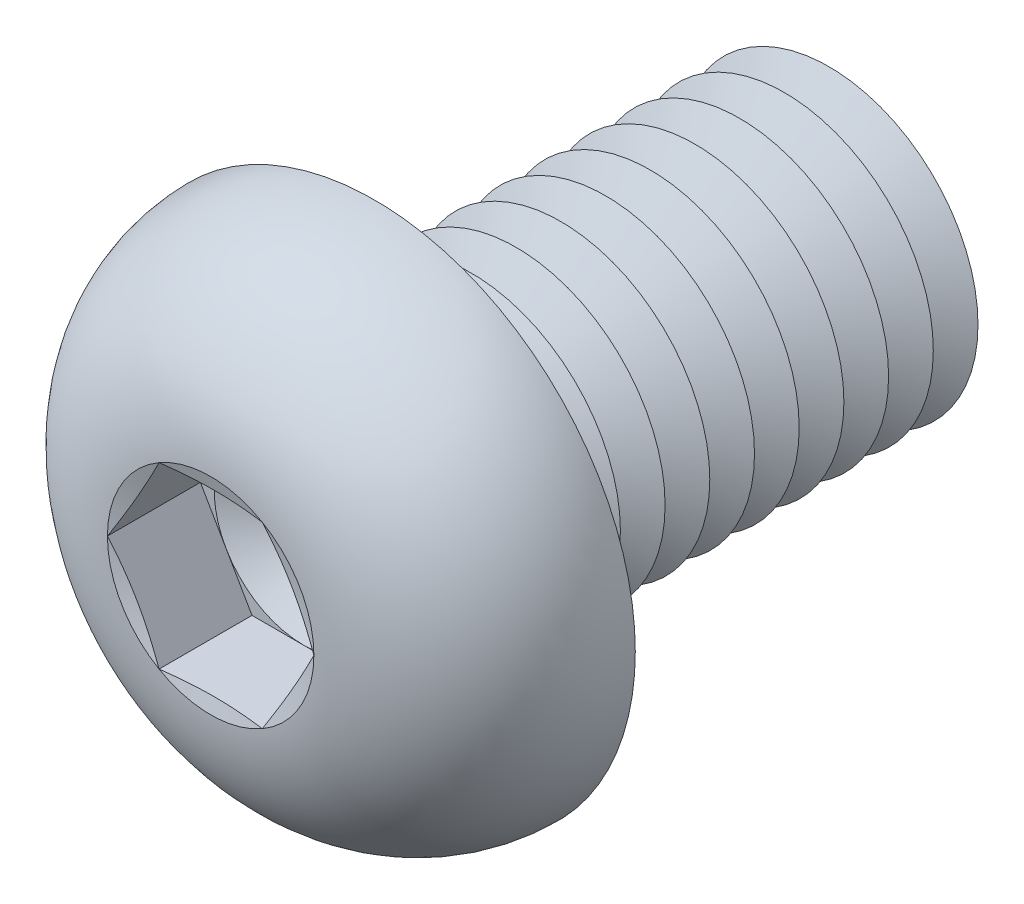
ISO-10303-21;
HEADER;
FILE_DESCRIPTION(('STEP AP214'),'2;1');
FILE_NAME('part.step','',(''),(''),'','','');
FILE_SCHEMA(('AUTOMOTIVE_DESIGN { 1 0 10303 214 1 1 1 1 }'));
ENDSEC;
DATA;
#1=APPLICATION_CONTEXT('core data for automotive mechanical design processes');
#2=APPLICATION_PROTOCOL_DEFINITION('international standard','automotive_design',2000,#1);
#3=PRODUCT_CONTEXT('',#1,'mechanical');
#4=PRODUCT('Part','Part','',(#3));
#5=PRODUCT_RELATED_PRODUCT_CATEGORY('part','',(#4));
#6=PRODUCT_DEFINITION_FORMATION('','',#4);
#7=PRODUCT_DEFINITION_CONTEXT('part definition',#1,'design');
#8=PRODUCT_DEFINITION('design','',#6,#7);
#9=PRODUCT_DEFINITION_SHAPE('','',#8);
#10=(LENGTH_UNIT() NAMED_UNIT(*) SI_UNIT(.MILLI.,.METRE.));
#11=(NAMED_UNIT(*) PLANE_ANGLE_UNIT() SI_UNIT($,.RADIAN.));
#12=(NAMED_UNIT(*) SI_UNIT($,.STERADIAN.) SOLID_ANGLE_UNIT());
#13=UNCERTAINTY_MEASURE_WITH_UNIT(LENGTH_MEASURE(1.E-05),#10,'distance_accuracy_value','');
#14=(GEOMETRIC_REPRESENTATION_CONTEXT(3) GLOBAL_UNCERTAINTY_ASSIGNED_CONTEXT((#13)) GLOBAL_UNIT_ASSIGNED_CONTEXT((#10,
#11,#12)) REPRESENTATION_CONTEXT('',''));
#15=CARTESIAN_POINT('',(0.,0.,0.));
#16=DIRECTION('',(0.,0.,1.));
#17=DIRECTION('',(1.,0.,0.));
#18=AXIS2_PLACEMENT_3D('',#15,#16,#17);
#19=CARTESIAN_POINT('',(0.,0.,2.38));
#20=DIRECTION('',(0.,0.,1.));
#21=DIRECTION('',(1.,0.,0.));
#22=AXIS2_PLACEMENT_3D('',#19,#20,#21);
#23=PLANE('',#22);
#24=CARTESIAN_POINT('',(0.,0.,2.38));
#25=DIRECTION('',(0.,0.,1.));
#26=DIRECTION('',(1.,0.,0.));
#27=AXIS2_PLACEMENT_3D('',#24,#25,#26);
#28=CIRCLE('',#27,2.99999860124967);
#29=CARTESIAN_POINT('',(2.598075,1.49999930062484,2.38));
#30=VERTEX_POINT('',#29);
#31=CARTESIAN_POINT('',(0.,2.99999860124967,2.38));
#32=VERTEX_POINT('',#31);
#33=EDGE_CURVE('E118',#30,#32,#28,.T.);
#34=ORIENTED_EDGE('',*,*,#33,.F.);
#35=DIRECTION('',(-0.500000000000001,0.866025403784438,0.));
#36=VECTOR('',#35,1.);
#37=CARTESIAN_POINT('',(3.4641,0.,2.38));
#38=LINE('',#37,#36);
#39=CARTESIAN_POINT('',(1.73205,2.99999860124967,2.38));
#40=VERTEX_POINT('',#39);
#41=EDGE_CURVE('E125',#30,#40,#38,.T.);
#42=ORIENTED_EDGE('',*,*,#41,.T.);
#43=DIRECTION('',(-1.,0.,0.));
#44=VECTOR('',#43,1.);
#45=CARTESIAN_POINT('',(1.73205,2.99999860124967,2.38));
#46=LINE('',#45,#44);
#47=EDGE_CURVE('E136',#40,#32,#46,.T.);
#48=ORIENTED_EDGE('',*,*,#47,.T.);
#49=EDGE_LOOP('',(#34,#42,#48));
#50=FACE_BOUND('',#49,.T.);
#51=ADVANCED_FACE('F39',(#50),#23,.T.);
#52=CARTESIAN_POINT('',(0.,0.,2.38));
#53=DIRECTION('',(0.,0.,1.));
#54=DIRECTION('',(1.,0.,0.));
#55=AXIS2_PLACEMENT_3D('',#52,#53,#54);
#56=CIRCLE('',#55,2.99999860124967);
#57=CARTESIAN_POINT('',(-2.598075,1.49999930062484,2.38));
#58=VERTEX_POINT('',#57);
#59=EDGE_CURVE('E11',#32,#58,#56,.T.);
#60=ORIENTED_EDGE('',*,*,#59,.F.);
#61=CARTESIAN_POINT('',(-1.73205,2.99999860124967,2.38));
#62=VERTEX_POINT('',#61);
#63=EDGE_CURVE('E131',#32,#62,#46,.T.);
#64=ORIENTED_EDGE('',*,*,#63,.T.);
#65=DIRECTION('',(-0.5,-0.866025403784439,0.));
#66=VECTOR('',#65,1.);
#67=CARTESIAN_POINT('',(-1.73205,2.99999860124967,2.38));
#68=LINE('',#67,#66);
#69=EDGE_CURVE('E134',#62,#58,#68,.T.);
#70=ORIENTED_EDGE('',*,*,#69,.T.);
#71=EDGE_LOOP('',(#60,#64,#70));
#72=FACE_BOUND('',#71,.T.);
#73=ADVANCED_FACE('F130',(#72),#23,.T.);
#74=CARTESIAN_POINT('',(-2.598075,-1.49999930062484,2.38));
#75=VERTEX_POINT('',#74);
#76=EDGE_CURVE('E49',#58,#75,#56,.T.);
#77=ORIENTED_EDGE('',*,*,#76,.F.);
#78=CARTESIAN_POINT('',(-3.4641,0.,2.38));
#79=VERTEX_POINT('',#78);
#80=EDGE_CURVE('E143',#58,#79,#68,.T.);
#81=ORIENTED_EDGE('',*,*,#80,.T.);
#82=DIRECTION('',(0.5,-0.866025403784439,0.));
#83=VECTOR('',#82,1.);
#84=CARTESIAN_POINT('',(-3.4641,0.,2.38));
#85=LINE('',#84,#83);
#86=EDGE_CURVE('E151',#79,#75,#85,.T.);
#87=ORIENTED_EDGE('',*,*,#86,.T.);
#88=EDGE_LOOP('',(#77,#81,#87));
#89=FACE_BOUND('',#88,.T.);
#90=ADVANCED_FACE('F372',(#89),#23,.T.);
#91=CARTESIAN_POINT('',(0.,-2.99999860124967,2.38));
#92=VERTEX_POINT('',#91);
#93=EDGE_CURVE('E363',#75,#92,#56,.T.);
#94=ORIENTED_EDGE('',*,*,#93,.F.);
#95=CARTESIAN_POINT('',(-1.73205,-2.99999860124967,2.38));
#96=VERTEX_POINT('',#95);
#97=EDGE_CURVE('E150',#75,#96,#85,.T.);
#98=ORIENTED_EDGE('',*,*,#97,.T.);
#99=DIRECTION('',(1.,0.,0.));
#100=VECTOR('',#99,1.);
#101=CARTESIAN_POINT('',(-1.73205,-2.99999860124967,2.38));
#102=LINE('',#101,#100);
#103=EDGE_CURVE('E156',#96,#92,#102,.T.);
#104=ORIENTED_EDGE('',*,*,#103,.T.);
#105=EDGE_LOOP('',(#94,#98,#104));
#106=FACE_BOUND('',#105,.T.);
#107=ADVANCED_FACE('F369',(#106),#23,.T.);
#108=CARTESIAN_POINT('',(2.598075,-1.49999930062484,2.38));
#109=VERTEX_POINT('',#108);
#110=EDGE_CURVE('E56',#92,#109,#56,.T.);
#111=ORIENTED_EDGE('',*,*,#110,.F.);
#112=CARTESIAN_POINT('',(1.73205,-2.99999860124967,2.38));
#113=VERTEX_POINT('',#112);
#114=EDGE_CURVE('E155',#92,#113,#102,.T.);
#115=ORIENTED_EDGE('',*,*,#114,.T.);
#116=DIRECTION('',(0.5,0.866025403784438,0.));
#117=VECTOR('',#116,1.);
#118=CARTESIAN_POINT('',(1.73205,-2.99999860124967,2.38));
#119=LINE('',#118,#117);
#120=EDGE_CURVE('E161',#113,#109,#119,.T.);
#121=ORIENTED_EDGE('',*,*,#120,.T.);
#122=EDGE_LOOP('',(#111,#115,#121));
#123=FACE_BOUND('',#122,.T.);
#124=ADVANCED_FACE('F353',(#123),#23,.T.);
#125=CARTESIAN_POINT('',(0.,0.,5.5));
#126=DIRECTION('',(0.,0.,1.));
#127=DIRECTION('',(1.,0.,0.));
#128=AXIS2_PLACEMENT_3D('',#125,#126,#127);
#129=CONICAL_SURFACE('',#128,3.4641,1.30899693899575);
#130=CARTESIAN_POINT('',(3.46421547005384,-0.000199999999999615,5.50003094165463));
#131=CARTESIAN_POINT('',(3.39227822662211,0.124398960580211,5.48074619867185));
#132=CARTESIAN_POINT('',(3.32021054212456,0.24922385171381,5.46323875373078));
#133=CARTESIAN_POINT('',(3.17582062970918,0.49931451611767,5.43247971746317));
#134=CARTESIAN_POINT('',(3.10349831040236,0.62458044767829,5.41922985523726));
#135=CARTESIAN_POINT('',(2.95903767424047,0.874793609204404,5.39775958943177));
#136=CARTESIAN_POINT('',(2.88690033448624,0.999739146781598,5.38951357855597));
#137=CARTESIAN_POINT('',(2.74253364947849,1.24978958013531,5.37845651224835));
#138=CARTESIAN_POINT('',(2.67030432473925,1.37489444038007,5.3756444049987));
#139=CARTESIAN_POINT('',(2.52584567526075,1.6251041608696,5.3756444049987));
#140=CARTESIAN_POINT('',(2.45361635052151,1.75020902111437,5.37845651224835));
#141=CARTESIAN_POINT('',(2.30924966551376,2.00025945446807,5.38951357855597));
#142=CARTESIAN_POINT('',(2.23711232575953,2.12520499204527,5.39775958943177));
#143=CARTESIAN_POINT('',(2.09265168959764,2.37541815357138,5.41922985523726));
#144=CARTESIAN_POINT('',(2.02032937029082,2.500684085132,5.43247971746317));
#145=CARTESIAN_POINT('',(1.87593945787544,2.75077474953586,5.46323875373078));
#146=CARTESIAN_POINT('',(1.80387177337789,2.87559964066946,5.48074619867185));
#147=CARTESIAN_POINT('',(1.73193452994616,3.00019860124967,5.50003094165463));
#148=B_SPLINE_CURVE_WITH_KNOTS('',3,(#130,#131,#132,#133,#134,#135,#136,#137,#138,#139,#140,
#141,#142,#143,#144,#145,#146,#147),.UNSPECIFIED.,.F.,.F.,(4,2,2,2,2,2,2,2,4),(0.,
0.435506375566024,0.871189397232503,1.3046235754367,1.7379738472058,2.1713241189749,
2.6047582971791,3.04044131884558,3.4759476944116),.UNSPECIFIED.);
#149=CARTESIAN_POINT('',(3.4641,0.,5.5));
#150=VERTEX_POINT('',#149);
#151=CARTESIAN_POINT('',(1.73204999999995,2.9999986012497,5.5));
#152=VERTEX_POINT('',#151);
#153=EDGE_CURVE('E227',#150,#152,#148,.T.);
#154=ORIENTED_EDGE('',*,*,#153,.F.);
#155=CARTESIAN_POINT('',(0.,0.,5.5));
#156=DIRECTION('',(0.,0.,-1.));
#157=DIRECTION('',(-1.,0.,0.));
#158=AXIS2_PLACEMENT_3D('',#155,#156,#157);
#159=CIRCLE('',#158,3.4641);
#160=EDGE_CURVE('E307',#152,#150,#159,.T.);
#161=ORIENTED_EDGE('',*,*,#160,.F.);
#162=EDGE_LOOP('',(#154,#161));
#163=FACE_BOUND('',#162,.T.);
#164=ADVANCED_FACE('F347',(#163),#129,.F.);
#165=CARTESIAN_POINT('',(1.73193452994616,-3.00019860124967,5.50003094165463));
#166=CARTESIAN_POINT('',(1.80387177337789,-2.87559964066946,5.48074619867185));
#167=CARTESIAN_POINT('',(1.87593945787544,-2.75077474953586,5.46323875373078));
#168=CARTESIAN_POINT('',(2.02032937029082,-2.500684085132,5.43247971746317));
#169=CARTESIAN_POINT('',(2.09265168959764,-2.37541815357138,5.41922985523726));
#170=CARTESIAN_POINT('',(2.23711232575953,-2.12520499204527,5.39775958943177));
#171=CARTESIAN_POINT('',(2.30924966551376,-2.00025945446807,5.38951357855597));
#172=CARTESIAN_POINT('',(2.45361635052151,-1.75020902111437,5.37845651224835));
#173=CARTESIAN_POINT('',(2.52584567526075,-1.6251041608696,5.3756444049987));
#174=CARTESIAN_POINT('',(2.67030432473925,-1.37489444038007,5.3756444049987));
#175=CARTESIAN_POINT('',(2.74253364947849,-1.24978958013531,5.37845651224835));
#176=CARTESIAN_POINT('',(2.88690033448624,-0.999739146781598,5.38951357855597));
#177=CARTESIAN_POINT('',(2.95903767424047,-0.874793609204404,5.39775958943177));
#178=CARTESIAN_POINT('',(3.10349831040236,-0.624580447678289,5.41922985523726));
#179=CARTESIAN_POINT('',(3.17582062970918,-0.499314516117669,5.43247971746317));
#180=CARTESIAN_POINT('',(3.32021054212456,-0.249223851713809,5.46323875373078));
#181=CARTESIAN_POINT('',(3.39227822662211,-0.124398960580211,5.48074619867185));
#182=CARTESIAN_POINT('',(3.46421547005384,0.000200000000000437,5.50003094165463));
#183=B_SPLINE_CURVE_WITH_KNOTS('',3,(#165,#166,#167,#168,#169,#170,#171,#172,#173,#174,#175,
#176,#177,#178,#179,#180,#181,#182),.UNSPECIFIED.,.F.,.F.,(4,2,2,2,2,2,2,2,4),(0.,
0.435506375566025,0.871189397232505,1.3046235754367,1.7379738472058,2.1713241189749,
2.6047582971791,3.04044131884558,3.4759476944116),.UNSPECIFIED.);
#184=CARTESIAN_POINT('',(1.73205,-2.99999860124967,5.5));
#185=VERTEX_POINT('',#184);
#186=EDGE_CURVE('E230',#185,#150,#183,.T.);
#187=ORIENTED_EDGE('',*,*,#186,.F.);
#188=EDGE_CURVE('E289',#150,#185,#159,.T.);
#189=ORIENTED_EDGE('',*,*,#188,.F.);
#190=EDGE_LOOP('',(#187,#189));
#191=FACE_BOUND('',#190,.T.);
#192=ADVANCED_FACE('F287',(#191),#129,.F.);
#193=CARTESIAN_POINT('',(-5.2273006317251,-2.99999860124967,6.18672552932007));
#194=CARTESIAN_POINT('',(-5.10075887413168,-2.99999860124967,6.15732018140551));
#195=CARTESIAN_POINT('',(-4.97415993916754,-2.99999860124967,6.12816064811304));
#196=CARTESIAN_POINT('',(-4.72082394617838,-2.99999860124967,6.07043857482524));
#197=CARTESIAN_POINT('',(-4.59408688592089,-2.99999860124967,6.04187604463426));
#198=CARTESIAN_POINT('',(-4.21358997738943,-2.99999860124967,5.95723252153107));
#199=CARTESIAN_POINT('',(-3.95959339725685,-2.99999860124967,5.90220706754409));
#200=CARTESIAN_POINT('',(-3.44835573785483,-2.99999860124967,5.79574115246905));
#201=CARTESIAN_POINT('',(-3.19110656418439,-2.99999860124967,5.74433913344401));
#202=CARTESIAN_POINT('',(-2.67540790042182,-2.99999860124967,5.6477299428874));
#203=CARTESIAN_POINT('',(-2.41695830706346,-2.99999860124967,5.60252331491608));
#204=CARTESIAN_POINT('',(-1.9055512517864,-2.99999860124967,5.52251897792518));
#205=CARTESIAN_POINT('',(-1.65263426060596,-2.99999860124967,5.48747285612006));
#206=CARTESIAN_POINT('',(-1.27220564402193,-2.99999860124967,5.44439602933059));
#207=CARTESIAN_POINT('',(-1.1452320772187,-2.99999860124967,5.43161987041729));
#208=CARTESIAN_POINT('',(-0.890973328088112,-2.99999860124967,5.40972605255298));
#209=CARTESIAN_POINT('',(-0.76368816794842,-2.99999860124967,5.40060814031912));
#210=CARTESIAN_POINT('',(-0.50944206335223,-2.99999860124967,5.38647457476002));
#211=CARTESIAN_POINT('',(-0.382482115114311,-2.99999860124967,5.38144125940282));
#212=CARTESIAN_POINT('',(-0.128463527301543,-2.99999860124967,5.37566637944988));
#213=CARTESIAN_POINT('',(-0.00140488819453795,-2.99999860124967,5.37492479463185));
#214=CARTESIAN_POINT('',(0.252672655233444,-2.99999860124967,5.37777315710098));
#215=CARTESIAN_POINT('',(0.379691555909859,-2.99999860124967,5.38136342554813));
#216=CARTESIAN_POINT('',(0.633540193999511,-2.99999860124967,5.39268816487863));
#217=CARTESIAN_POINT('',(0.760369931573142,-2.99999860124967,5.40042263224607));
#218=CARTESIAN_POINT('',(1.06836981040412,-2.99999860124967,5.42382465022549));
#219=CARTESIAN_POINT('',(1.24938929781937,-2.99999860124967,5.44147485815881));
#220=CARTESIAN_POINT('',(1.61066786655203,-2.99999860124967,5.48312309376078));
#221=CARTESIAN_POINT('',(1.7909269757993,-2.99999860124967,5.50712088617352));
#222=CARTESIAN_POINT('',(2.15127612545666,-2.99999860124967,5.56013471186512));
#223=CARTESIAN_POINT('',(2.33136383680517,-2.99999860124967,5.58916634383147));
#224=CARTESIAN_POINT('',(2.690892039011,-2.99999860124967,5.65100028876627));
#225=CARTESIAN_POINT('',(2.87033249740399,-2.99999860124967,5.68380278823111));
#226=CARTESIAN_POINT('',(3.23235399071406,-2.99999860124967,5.75295369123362));
#227=CARTESIAN_POINT('',(3.4149236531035,-2.99999860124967,5.78936117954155));
#228=CARTESIAN_POINT('',(3.77960351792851,-2.99999860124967,5.864406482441));
#229=CARTESIAN_POINT('',(3.96171371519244,-2.99999860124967,5.903044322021));
#230=CARTESIAN_POINT('',(4.32457472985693,-2.99999860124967,5.9817966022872));
#231=CARTESIAN_POINT('',(4.5053275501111,-2.99999860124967,6.02190185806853));
#232=CARTESIAN_POINT('',(4.86652484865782,-2.99999860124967,6.10342152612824));
#233=CARTESIAN_POINT('',(5.04696934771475,-2.99999860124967,6.14483584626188));
#234=CARTESIAN_POINT('',(5.2273006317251,-2.99999860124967,6.18672552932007));
#235=B_SPLINE_CURVE_WITH_KNOTS('',3,(#193,#194,#195,#196,#197,#198,#199,#200,#201,#202,#203,
#204,#205,#206,#207,#208,#209,#210,#211,#212,#213,#214,#215,#216,#217,#218,#219,#220,#221,#222,
#223,#224,#225,#226,#227,#228,#229,#230,#231,#232,#233,#234),.UNSPECIFIED.,.F.,.F.,(4,2,2,2,2,2,
2,2,2,2,2,2,2,2,2,2,2,2,2,2,4),(0.,0.389739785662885,0.779485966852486,1.5591292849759,
2.34608117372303,3.13310206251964,3.8988410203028,4.28164148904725,4.66441544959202,
5.04552531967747,5.42663339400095,5.80776972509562,6.18890573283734,6.73438998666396,
7.27985402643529,7.8270395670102,8.37425218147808,8.93272720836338,9.49120849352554,
10.0466490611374,10.6020506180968),.UNSPECIFIED.);
#236=CARTESIAN_POINT('',(-1.73205,-2.99999860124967,5.5));
#237=VERTEX_POINT('',#236);
#238=EDGE_CURVE('E240',#237,#185,#235,.T.);
#239=ORIENTED_EDGE('',*,*,#238,.F.);
#240=EDGE_CURVE('E294',#185,#237,#159,.T.);
#241=ORIENTED_EDGE('',*,*,#240,.F.);
#242=EDGE_LOOP('',(#239,#241));
#243=FACE_BOUND('',#242,.T.);
#244=ADVANCED_FACE('F295',(#243),#129,.F.);
#245=CARTESIAN_POINT('',(-3.46421547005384,0.000200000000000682,5.50003094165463));
#246=CARTESIAN_POINT('',(-3.39227822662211,-0.12439896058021,5.48074619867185));
#247=CARTESIAN_POINT('',(-3.32021054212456,-0.249223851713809,5.46323875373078));
#248=CARTESIAN_POINT('',(-3.17582062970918,-0.499314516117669,5.43247971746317));
#249=CARTESIAN_POINT('',(-3.10349831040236,-0.624580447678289,5.41922985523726));
#250=CARTESIAN_POINT('',(-2.95903767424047,-0.874793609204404,5.39775958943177));
#251=CARTESIAN_POINT('',(-2.88690033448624,-0.999739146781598,5.38951357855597));
#252=CARTESIAN_POINT('',(-2.74253364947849,-1.24978958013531,5.37845651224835));
#253=CARTESIAN_POINT('',(-2.67030432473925,-1.37489444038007,5.3756444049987));
#254=CARTESIAN_POINT('',(-2.52584567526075,-1.6251041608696,5.3756444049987));
#255=CARTESIAN_POINT('',(-2.45361635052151,-1.75020902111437,5.37845651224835));
#256=CARTESIAN_POINT('',(-2.30924966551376,-2.00025945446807,5.38951357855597));
#257=CARTESIAN_POINT('',(-2.23711232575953,-2.12520499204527,5.39775958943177));
#258=CARTESIAN_POINT('',(-2.09265168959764,-2.37541815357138,5.41922985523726));
#259=CARTESIAN_POINT('',(-2.02032937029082,-2.500684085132,5.43247971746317));
#260=CARTESIAN_POINT('',(-1.87593945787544,-2.75077474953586,5.46323875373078));
#261=CARTESIAN_POINT('',(-1.80387177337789,-2.87559964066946,5.48074619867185));
#262=CARTESIAN_POINT('',(-1.73193452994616,-3.00019860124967,5.50003094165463));
#263=B_SPLINE_CURVE_WITH_KNOTS('',3,(#245,#246,#247,#248,#249,#250,#251,#252,#253,#254,#255,
#256,#257,#258,#259,#260,#261,#262),.UNSPECIFIED.,.F.,.F.,(4,2,2,2,2,2,2,2,4),(0.,
0.435506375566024,0.871189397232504,1.3046235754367,1.7379738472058,2.1713241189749,
2.6047582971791,3.04044131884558,3.4759476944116),.UNSPECIFIED.);
#264=CARTESIAN_POINT('',(-3.4641,0.,5.5));
#265=VERTEX_POINT('',#264);
#266=EDGE_CURVE('E235',#265,#237,#263,.T.);
#267=ORIENTED_EDGE('',*,*,#266,.F.);
#268=EDGE_CURVE('E300',#237,#265,#159,.T.);
#269=ORIENTED_EDGE('',*,*,#268,.F.);
#270=EDGE_LOOP('',(#267,#269));
#271=FACE_BOUND('',#270,.T.);
#272=ADVANCED_FACE('F378',(#271),#129,.F.);
#273=CARTESIAN_POINT('',(-1.73193452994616,3.00019860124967,5.50003094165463));
#274=CARTESIAN_POINT('',(-1.8038717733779,2.87559964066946,5.48074619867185));
#275=CARTESIAN_POINT('',(-1.87593945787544,2.75077474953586,5.46323875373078));
#276=CARTESIAN_POINT('',(-2.02032937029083,2.500684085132,5.43247971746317));
#277=CARTESIAN_POINT('',(-2.09265168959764,2.37541815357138,5.41922985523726));
#278=CARTESIAN_POINT('',(-2.23711232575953,2.12520499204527,5.39775958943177));
#279=CARTESIAN_POINT('',(-2.30924966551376,2.00025945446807,5.38951357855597));
#280=CARTESIAN_POINT('',(-2.45361635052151,1.75020902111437,5.37845651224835));
#281=CARTESIAN_POINT('',(-2.52584567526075,1.6251041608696,5.3756444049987));
#282=CARTESIAN_POINT('',(-2.67030432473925,1.37489444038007,5.3756444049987));
#283=CARTESIAN_POINT('',(-2.74253364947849,1.24978958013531,5.37845651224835));
#284=CARTESIAN_POINT('',(-2.88690033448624,0.999739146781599,5.38951357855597));
#285=CARTESIAN_POINT('',(-2.95903767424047,0.874793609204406,5.39775958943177));
#286=CARTESIAN_POINT('',(-3.10349831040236,0.624580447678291,5.41922985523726));
#287=CARTESIAN_POINT('',(-3.17582062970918,0.499314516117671,5.43247971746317));
#288=CARTESIAN_POINT('',(-3.32021054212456,0.249223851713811,5.46323875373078));
#289=CARTESIAN_POINT('',(-3.39227822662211,0.124398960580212,5.48074619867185));
#290=CARTESIAN_POINT('',(-3.46421547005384,-0.000199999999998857,5.50003094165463));
#291=B_SPLINE_CURVE_WITH_KNOTS('',3,(#273,#274,#275,#276,#277,#278,#279,#280,#281,#282,#283,
#284,#285,#286,#287,#288,#289,#290),.UNSPECIFIED.,.F.,.F.,(4,2,2,2,2,2,2,2,4),(0.,
0.435506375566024,0.871189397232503,1.3046235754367,1.7379738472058,2.1713241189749,
2.6047582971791,3.04044131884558,3.4759476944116),.UNSPECIFIED.);
#292=CARTESIAN_POINT('',(-1.73205,2.99999860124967,5.5));
#293=VERTEX_POINT('',#292);
#294=EDGE_CURVE('E232',#293,#265,#291,.T.);
#295=ORIENTED_EDGE('',*,*,#294,.F.);
#296=EDGE_CURVE('E330',#265,#293,#159,.T.);
#297=ORIENTED_EDGE('',*,*,#296,.F.);
#298=EDGE_LOOP('',(#295,#297));
#299=FACE_BOUND('',#298,.T.);
#300=ADVANCED_FACE('F382',(#299),#129,.F.);
#301=CARTESIAN_POINT('',(0.,0.,-10.75));
#302=DIRECTION('',(0.,0.,1.));
#303=DIRECTION('',(1.,0.,0.));
#304=AXIS2_PLACEMENT_3D('',#301,#302,#303);
#305=CONICAL_SURFACE('',#304,5.,1.0471975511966);
#306=CARTESIAN_POINT('',(0.,0.,-11.5));
#307=DIRECTION('',(0.,0.,1.));
#308=DIRECTION('',(1.,0.,0.));
#309=AXIS2_PLACEMENT_3D('',#306,#307,#308);
#310=CIRCLE('',#309,3.70096189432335);
#311=CARTESIAN_POINT('',(3.70096189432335,0.,-11.5));
#312=VERTEX_POINT('',#311);
#313=EDGE_CURVE('E833',#312,#312,#310,.T.);
#314=ORIENTED_EDGE('',*,*,#313,.T.);
#315=EDGE_LOOP('',(#314));
#316=FACE_BOUND('',#315,.T.);
#317=CARTESIAN_POINT('',(0.,0.,-10.75));
#318=DIRECTION('',(0.,0.,1.));
#319=DIRECTION('',(1.,0.,0.));
#320=AXIS2_PLACEMENT_3D('',#317,#318,#319);
#321=CIRCLE('',#320,5.);
#322=CARTESIAN_POINT('',(5.,0.,-10.75));
#323=VERTEX_POINT('',#322);
#324=EDGE_CURVE('E829',#323,#323,#321,.T.);
#325=ORIENTED_EDGE('',*,*,#324,.F.);
#326=EDGE_LOOP('',(#325));
#327=FACE_BOUND('',#326,.T.);
#328=ADVANCED_FACE('F384',(#316,#327),#305,.T.);
#329=CARTESIAN_POINT('',(0.,0.,-11.5));
#330=DIRECTION('',(0.,0.,-1.));
#331=DIRECTION('',(-1.,0.,0.));
#332=AXIS2_PLACEMENT_3D('',#329,#330,#331);
#333=CONICAL_SURFACE('',#332,3.70096189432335,1.0471975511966);
#334=CARTESIAN_POINT('',(0.,0.,-12.25));
#335=DIRECTION('',(0.,0.,1.));
#336=DIRECTION('',(1.,0.,0.));
#337=AXIS2_PLACEMENT_3D('',#334,#335,#336);
#338=CIRCLE('',#337,5.);
#339=CARTESIAN_POINT('',(5.,0.,-12.25));
#340=VERTEX_POINT('',#339);
#341=EDGE_CURVE('E837',#340,#340,#338,.T.);
#342=ORIENTED_EDGE('',*,*,#341,.T.);
#343=EDGE_LOOP('',(#342));
#344=FACE_BOUND('',#343,.T.);
#345=ORIENTED_EDGE('',*,*,#313,.F.);
#346=EDGE_LOOP('',(#345));
#347=FACE_BOUND('',#346,.T.);
#348=ADVANCED_FACE('F389',(#344,#347),#333,.T.);
#349=CARTESIAN_POINT('',(0.,5.00000000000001,-16.));
#350=DIRECTION('',(0.,0.,-1.));
#351=DIRECTION('',(-1.,0.,0.));
#352=AXIS2_PLACEMENT_3D('',#349,#350,#351);
#353=PLANE('',#352);
#354=CARTESIAN_POINT('',(0.,0.,-16.));
#355=DIRECTION('',(0.,0.,1.));
#356=DIRECTION('',(1.,0.,0.));
#357=AXIS2_PLACEMENT_3D('',#354,#355,#356);
#358=CIRCLE('',#357,3.70096189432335);
#359=CARTESIAN_POINT('',(3.70096189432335,0.,-16.));
#360=VERTEX_POINT('',#359);
#361=EDGE_CURVE('E320',#360,#360,#358,.T.);
#362=ORIENTED_EDGE('',*,*,#361,.F.);
#363=EDGE_LOOP('',(#362));
#364=FACE_BOUND('',#363,.T.);
#365=ADVANCED_FACE('F649',(#364),#353,.T.);
#366=CARTESIAN_POINT('',(0.,0.,-15.25));
#367=DIRECTION('',(0.,0.,1.));
#368=DIRECTION('',(1.,0.,0.));
#369=AXIS2_PLACEMENT_3D('',#366,#367,#368);
#370=CONICAL_SURFACE('',#369,5.,1.0471975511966);
#371=ORIENTED_EDGE('',*,*,#361,.T.);
#372=EDGE_LOOP('',(#371));
#373=FACE_BOUND('',#372,.T.);
#374=CARTESIAN_POINT('',(0.,0.,-15.25));
#375=DIRECTION('',(0.,0.,1.));
#376=DIRECTION('',(1.,0.,0.));
#377=AXIS2_PLACEMENT_3D('',#374,#375,#376);
#378=CIRCLE('',#377,5.);
#379=CARTESIAN_POINT('',(5.,0.,-15.25));
#380=VERTEX_POINT('',#379);
#381=EDGE_CURVE('E851',#380,#380,#378,.T.);
#382=ORIENTED_EDGE('',*,*,#381,.F.);
#383=EDGE_LOOP('',(#382));
#384=FACE_BOUND('',#383,.T.);
#385=ADVANCED_FACE('F638',(#373,#384),#370,.T.);
#386=CARTESIAN_POINT('',(0.,0.,-14.5));
#387=DIRECTION('',(0.,0.,-1.));
#388=DIRECTION('',(-1.,0.,0.));
#389=AXIS2_PLACEMENT_3D('',#386,#387,#388);
#390=CONICAL_SURFACE('',#389,3.70096189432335,1.0471975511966);
#391=ORIENTED_EDGE('',*,*,#381,.T.);
#392=EDGE_LOOP('',(#391));
#393=FACE_BOUND('',#392,.T.);
#394=CARTESIAN_POINT('',(0.,0.,-14.5));
#395=DIRECTION('',(0.,0.,1.));
#396=DIRECTION('',(1.,0.,0.));
#397=AXIS2_PLACEMENT_3D('',#394,#395,#396);
#398=CIRCLE('',#397,3.70096189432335);
#399=CARTESIAN_POINT('',(3.70096189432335,0.,-14.5));
#400=VERTEX_POINT('',#399);
#401=EDGE_CURVE('E848',#400,#400,#398,.T.);
#402=ORIENTED_EDGE('',*,*,#401,.F.);
#403=EDGE_LOOP('',(#402));
#404=FACE_BOUND('',#403,.T.);
#405=ADVANCED_FACE('F628',(#393,#404),#390,.T.);
#406=CARTESIAN_POINT('',(0.,0.,-13.75));
#407=DIRECTION('',(0.,0.,1.));
#408=DIRECTION('',(1.,0.,0.));
#409=AXIS2_PLACEMENT_3D('',#406,#407,#408);
#410=CONICAL_SURFACE('',#409,5.,1.0471975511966);
#411=ORIENTED_EDGE('',*,*,#401,.T.);
#412=EDGE_LOOP('',(#411));
#413=FACE_BOUND('',#412,.T.);
#414=CARTESIAN_POINT('',(0.,0.,-13.75));
#415=DIRECTION('',(0.,0.,1.));
#416=DIRECTION('',(1.,0.,0.));
#417=AXIS2_PLACEMENT_3D('',#414,#415,#416);
#418=CIRCLE('',#417,5.);
#419=CARTESIAN_POINT('',(5.,0.,-13.75));
#420=VERTEX_POINT('',#419);
#421=EDGE_CURVE('E845',#420,#420,#418,.T.);
#422=ORIENTED_EDGE('',*,*,#421,.F.);
#423=EDGE_LOOP('',(#422));
#424=FACE_BOUND('',#423,.T.);
#425=ADVANCED_FACE('F618',(#413,#424),#410,.T.);
#426=CARTESIAN_POINT('',(0.,0.,-13.));
#427=DIRECTION('',(0.,0.,-1.));
#428=DIRECTION('',(-1.,0.,0.));
#429=AXIS2_PLACEMENT_3D('',#426,#427,#428);
#430=CONICAL_SURFACE('',#429,3.70096189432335,1.0471975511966);
#431=ORIENTED_EDGE('',*,*,#421,.T.);
#432=EDGE_LOOP('',(#431));
#433=FACE_BOUND('',#432,.T.);
#434=CARTESIAN_POINT('',(0.,0.,-13.));
#435=DIRECTION('',(0.,0.,1.));
#436=DIRECTION('',(1.,0.,0.));
#437=AXIS2_PLACEMENT_3D('',#434,#435,#436);
#438=CIRCLE('',#437,3.70096189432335);
#439=CARTESIAN_POINT('',(3.70096189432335,0.,-13.));
#440=VERTEX_POINT('',#439);
#441=EDGE_CURVE('E841',#440,#440,#438,.T.);
#442=ORIENTED_EDGE('',*,*,#441,.F.);
#443=EDGE_LOOP('',(#442));
#444=FACE_BOUND('',#443,.T.);
#445=ADVANCED_FACE('F608',(#433,#444),#430,.T.);
#446=CARTESIAN_POINT('',(0.,0.,-12.25));
#447=DIRECTION('',(0.,0.,1.));
#448=DIRECTION('',(1.,0.,0.));
#449=AXIS2_PLACEMENT_3D('',#446,#447,#448);
#450=CONICAL_SURFACE('',#449,5.,1.0471975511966);
#451=ORIENTED_EDGE('',*,*,#441,.T.);
#452=EDGE_LOOP('',(#451));
#453=FACE_BOUND('',#452,.T.);
#454=ORIENTED_EDGE('',*,*,#341,.F.);
#455=EDGE_LOOP('',(#454));
#456=FACE_BOUND('',#455,.T.);
#457=ADVANCED_FACE('F598',(#453,#456),#450,.T.);
#458=CARTESIAN_POINT('',(0.,0.,-9.25));
#459=DIRECTION('',(0.,0.,1.));
#460=DIRECTION('',(1.,0.,0.));
#461=AXIS2_PLACEMENT_3D('',#458,#459,#460);
#462=CONICAL_SURFACE('',#461,5.,1.0471975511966);
#463=CARTESIAN_POINT('',(0.,0.,-10.));
#464=DIRECTION('',(0.,0.,1.));
#465=DIRECTION('',(1.,0.,0.));
#466=AXIS2_PLACEMENT_3D('',#463,#464,#465);
#467=CIRCLE('',#466,3.70096189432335);
#468=CARTESIAN_POINT('',(3.70096189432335,0.,-10.));
#469=VERTEX_POINT('',#468);
#470=EDGE_CURVE('E359',#469,#469,#467,.T.);
#471=ORIENTED_EDGE('',*,*,#470,.T.);
#472=EDGE_LOOP('',(#471));
#473=FACE_BOUND('',#472,.T.);
#474=CARTESIAN_POINT('',(0.,0.,-9.25));
#475=DIRECTION('',(0.,0.,1.));
#476=DIRECTION('',(1.,0.,0.));
#477=AXIS2_PLACEMENT_3D('',#474,#475,#476);
#478=CIRCLE('',#477,5.);
#479=CARTESIAN_POINT('',(5.,0.,-9.25));
#480=VERTEX_POINT('',#479);
#481=EDGE_CURVE('E357',#480,#480,#478,.T.);
#482=ORIENTED_EDGE('',*,*,#481,.F.);
#483=EDGE_LOOP('',(#482));
#484=FACE_BOUND('',#483,.T.);
#485=ADVANCED_FACE('F588',(#473,#484),#462,.T.);
#486=CARTESIAN_POINT('',(0.,0.,-10.));
#487=DIRECTION('',(0.,0.,-1.));
#488=DIRECTION('',(-1.,0.,0.));
#489=AXIS2_PLACEMENT_3D('',#486,#487,#488);
#490=CONICAL_SURFACE('',#489,3.70096189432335,1.0471975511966);
#491=ORIENTED_EDGE('',*,*,#324,.T.);
#492=EDGE_LOOP('',(#491));
#493=FACE_BOUND('',#492,.T.);
#494=ORIENTED_EDGE('',*,*,#470,.F.);
#495=EDGE_LOOP('',(#494));
#496=FACE_BOUND('',#495,.T.);
#497=ADVANCED_FACE('F578',(#493,#496),#490,.T.);
#498=CARTESIAN_POINT('',(0.,0.,-7.75));
#499=DIRECTION('',(0.,0.,1.));
#500=DIRECTION('',(1.,0.,0.));
#501=AXIS2_PLACEMENT_3D('',#498,#499,#500);
#502=CONICAL_SURFACE('',#501,5.,1.0471975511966);
#503=CARTESIAN_POINT('',(0.,0.,-8.5));
#504=DIRECTION('',(0.,0.,1.));
#505=DIRECTION('',(1.,0.,0.));
#506=AXIS2_PLACEMENT_3D('',#503,#504,#505);
#507=CIRCLE('',#506,3.70096189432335);
#508=CARTESIAN_POINT('',(3.70096189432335,0.,-8.5));
#509=VERTEX_POINT('',#508);
#510=EDGE_CURVE('E360',#509,#509,#507,.T.);
#511=ORIENTED_EDGE('',*,*,#510,.T.);
#512=EDGE_LOOP('',(#511));
#513=FACE_BOUND('',#512,.T.);
#514=CARTESIAN_POINT('',(0.,0.,-7.75));
#515=DIRECTION('',(0.,0.,1.));
#516=DIRECTION('',(1.,0.,0.));
#517=AXIS2_PLACEMENT_3D('',#514,#515,#516);
#518=CIRCLE('',#517,5.);
#519=CARTESIAN_POINT('',(5.,0.,-7.75));
#520=VERTEX_POINT('',#519);
#521=EDGE_CURVE('E819',#520,#520,#518,.T.);
#522=ORIENTED_EDGE('',*,*,#521,.F.);
#523=EDGE_LOOP('',(#522));
#524=FACE_BOUND('',#523,.T.);
#525=ADVANCED_FACE('F568',(#513,#524),#502,.T.);
#526=CARTESIAN_POINT('',(0.,0.,-8.5));
#527=DIRECTION('',(0.,0.,-1.));
#528=DIRECTION('',(-1.,0.,0.));
#529=AXIS2_PLACEMENT_3D('',#526,#527,#528);
#530=CONICAL_SURFACE('',#529,3.70096189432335,1.0471975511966);
#531=ORIENTED_EDGE('',*,*,#481,.T.);
#532=EDGE_LOOP('',(#531));
#533=FACE_BOUND('',#532,.T.);
#534=ORIENTED_EDGE('',*,*,#510,.F.);
#535=EDGE_LOOP('',(#534));
#536=FACE_BOUND('',#535,.T.);
#537=ADVANCED_FACE('F558',(#533,#536),#530,.T.);
#538=CARTESIAN_POINT('',(0.,0.,-6.25));
#539=DIRECTION('',(0.,0.,1.));
#540=DIRECTION('',(1.,0.,0.));
#541=AXIS2_PLACEMENT_3D('',#538,#539,#540);
#542=CONICAL_SURFACE('',#541,5.,1.0471975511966);
#543=CARTESIAN_POINT('',(0.,0.,-7.));
#544=DIRECTION('',(0.,0.,1.));
#545=DIRECTION('',(1.,0.,0.));
#546=AXIS2_PLACEMENT_3D('',#543,#544,#545);
#547=CIRCLE('',#546,3.70096189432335);
#548=CARTESIAN_POINT('',(3.70096189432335,0.,-7.));
#549=VERTEX_POINT('',#548);
#550=EDGE_CURVE('E815',#549,#549,#547,.T.);
#551=ORIENTED_EDGE('',*,*,#550,.T.);
#552=EDGE_LOOP('',(#551));
#553=FACE_BOUND('',#552,.T.);
#554=CARTESIAN_POINT('',(0.,0.,-6.25));
#555=DIRECTION('',(0.,0.,1.));
#556=DIRECTION('',(1.,0.,0.));
#557=AXIS2_PLACEMENT_3D('',#554,#555,#556);
#558=CIRCLE('',#557,5.);
#559=CARTESIAN_POINT('',(5.,0.,-6.25));
#560=VERTEX_POINT('',#559);
#561=EDGE_CURVE('E812',#560,#560,#558,.T.);
#562=ORIENTED_EDGE('',*,*,#561,.F.);
#563=EDGE_LOOP('',(#562));
#564=FACE_BOUND('',#563,.T.);
#565=ADVANCED_FACE('F548',(#553,#564),#542,.T.);
#566=CARTESIAN_POINT('',(0.,0.,-7.));
#567=DIRECTION('',(0.,0.,-1.));
#568=DIRECTION('',(-1.,0.,0.));
#569=AXIS2_PLACEMENT_3D('',#566,#567,#568);
#570=CONICAL_SURFACE('',#569,3.70096189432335,1.0471975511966);
#571=ORIENTED_EDGE('',*,*,#521,.T.);
#572=EDGE_LOOP('',(#571));
#573=FACE_BOUND('',#572,.T.);
#574=ORIENTED_EDGE('',*,*,#550,.F.);
#575=EDGE_LOOP('',(#574));
#576=FACE_BOUND('',#575,.T.);
#577=ADVANCED_FACE('F538',(#573,#576),#570,.T.);
#578=CARTESIAN_POINT('',(0.,0.,-4.75));
#579=DIRECTION('',(0.,0.,1.));
#580=DIRECTION('',(1.,0.,0.));
#581=AXIS2_PLACEMENT_3D('',#578,#579,#580);
#582=CONICAL_SURFACE('',#581,5.,1.0471975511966);
#583=CARTESIAN_POINT('',(0.,0.,-5.5));
#584=DIRECTION('',(0.,0.,1.));
#585=DIRECTION('',(1.,0.,0.));
#586=AXIS2_PLACEMENT_3D('',#583,#584,#585);
#587=CIRCLE('',#586,3.70096189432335);
#588=CARTESIAN_POINT('',(3.70096189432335,0.,-5.5));
#589=VERTEX_POINT('',#588);
#590=EDGE_CURVE('E808',#589,#589,#587,.T.);
#591=ORIENTED_EDGE('',*,*,#590,.T.);
#592=EDGE_LOOP('',(#591));
#593=FACE_BOUND('',#592,.T.);
#594=CARTESIAN_POINT('',(0.,0.,-4.75));
#595=DIRECTION('',(0.,0.,1.));
#596=DIRECTION('',(1.,0.,0.));
#597=AXIS2_PLACEMENT_3D('',#594,#595,#596);
#598=CIRCLE('',#597,5.);
#599=CARTESIAN_POINT('',(5.,0.,-4.75));
#600=VERTEX_POINT('',#599);
#601=EDGE_CURVE('E801',#600,#600,#598,.T.);
#602=ORIENTED_EDGE('',*,*,#601,.F.);
#603=EDGE_LOOP('',(#602));
#604=FACE_BOUND('',#603,.T.);
#605=ADVANCED_FACE('F528',(#593,#604),#582,.T.);
#606=CARTESIAN_POINT('',(0.,0.,-5.5));
#607=DIRECTION('',(0.,0.,-1.));
#608=DIRECTION('',(-1.,0.,0.));
#609=AXIS2_PLACEMENT_3D('',#606,#607,#608);
#610=CONICAL_SURFACE('',#609,3.70096189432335,1.0471975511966);
#611=ORIENTED_EDGE('',*,*,#561,.T.);
#612=EDGE_LOOP('',(#611));
#613=FACE_BOUND('',#612,.T.);
#614=ORIENTED_EDGE('',*,*,#590,.F.);
#615=EDGE_LOOP('',(#614));
#616=FACE_BOUND('',#615,.T.);
#617=ADVANCED_FACE('F518',(#613,#616),#610,.T.);
#618=CARTESIAN_POINT('',(0.,0.,-3.25));
#619=DIRECTION('',(0.,0.,1.));
#620=DIRECTION('',(1.,0.,0.));
#621=AXIS2_PLACEMENT_3D('',#618,#619,#620);
#622=CONICAL_SURFACE('',#621,5.,1.0471975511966);
#623=CARTESIAN_POINT('',(0.,0.,-4.));
#624=DIRECTION('',(0.,0.,1.));
#625=DIRECTION('',(1.,0.,0.));
#626=AXIS2_PLACEMENT_3D('',#623,#624,#625);
#627=CIRCLE('',#626,3.70096189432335);
#628=CARTESIAN_POINT('',(3.70096189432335,0.,-4.));
#629=VERTEX_POINT('',#628);
#630=EDGE_CURVE('E796',#629,#629,#627,.T.);
#631=ORIENTED_EDGE('',*,*,#630,.T.);
#632=EDGE_LOOP('',(#631));
#633=FACE_BOUND('',#632,.T.);
#634=CARTESIAN_POINT('',(0.,0.,-3.25));
#635=DIRECTION('',(0.,0.,1.));
#636=DIRECTION('',(1.,0.,0.));
#637=AXIS2_PLACEMENT_3D('',#634,#635,#636);
#638=CIRCLE('',#637,5.);
#639=CARTESIAN_POINT('',(5.,0.,-3.25));
#640=VERTEX_POINT('',#639);
#641=EDGE_CURVE('E797',#640,#640,#638,.T.);
#642=ORIENTED_EDGE('',*,*,#641,.F.);
#643=EDGE_LOOP('',(#642));
#644=FACE_BOUND('',#643,.T.);
#645=ADVANCED_FACE('F508',(#633,#644),#622,.T.);
#646=CARTESIAN_POINT('',(0.,0.,-4.));
#647=DIRECTION('',(0.,0.,-1.));
#648=DIRECTION('',(-1.,0.,0.));
#649=AXIS2_PLACEMENT_3D('',#646,#647,#648);
#650=CONICAL_SURFACE('',#649,3.70096189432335,1.0471975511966);
#651=ORIENTED_EDGE('',*,*,#601,.T.);
#652=EDGE_LOOP('',(#651));
#653=FACE_BOUND('',#652,.T.);
#654=ORIENTED_EDGE('',*,*,#630,.F.);
#655=EDGE_LOOP('',(#654));
#656=FACE_BOUND('',#655,.T.);
#657=ADVANCED_FACE('F499',(#653,#656),#650,.T.);
#658=CARTESIAN_POINT('',(0.,0.,-1.75));
#659=DIRECTION('',(0.,0.,1.));
#660=DIRECTION('',(1.,0.,0.));
#661=AXIS2_PLACEMENT_3D('',#658,#659,#660);
#662=CONICAL_SURFACE('',#661,5.,1.0471975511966);
#663=CARTESIAN_POINT('',(0.,0.,-2.5));
#664=DIRECTION('',(0.,0.,1.));
#665=DIRECTION('',(1.,0.,0.));
#666=AXIS2_PLACEMENT_3D('',#663,#664,#665);
#667=CIRCLE('',#666,3.70096189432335);
#668=CARTESIAN_POINT('',(3.70096189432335,0.,-2.5));
#669=VERTEX_POINT('',#668);
#670=EDGE_CURVE('E224',#669,#669,#667,.T.);
#671=ORIENTED_EDGE('',*,*,#670,.T.);
#672=EDGE_LOOP('',(#671));
#673=FACE_BOUND('',#672,.T.);
#674=CARTESIAN_POINT('',(0.,0.,-1.75));
#675=DIRECTION('',(0.,0.,1.));
#676=DIRECTION('',(1.,0.,0.));
#677=AXIS2_PLACEMENT_3D('',#674,#675,#676);
#678=CIRCLE('',#677,5.);
#679=CARTESIAN_POINT('',(5.,0.,-1.75));
#680=VERTEX_POINT('',#679);
#681=EDGE_CURVE('E793',#680,#680,#678,.T.);
#682=ORIENTED_EDGE('',*,*,#681,.F.);
#683=EDGE_LOOP('',(#682));
#684=FACE_BOUND('',#683,.T.);
#685=ADVANCED_FACE('F490',(#673,#684),#662,.T.);
#686=CARTESIAN_POINT('',(0.,0.,-2.5));
#687=DIRECTION('',(0.,0.,-1.));
#688=DIRECTION('',(-1.,0.,0.));
#689=AXIS2_PLACEMENT_3D('',#686,#687,#688);
#690=CONICAL_SURFACE('',#689,3.70096189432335,1.0471975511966);
#691=ORIENTED_EDGE('',*,*,#641,.T.);
#692=EDGE_LOOP('',(#691));
#693=FACE_BOUND('',#692,.T.);
#694=ORIENTED_EDGE('',*,*,#670,.F.);
#695=EDGE_LOOP('',(#694));
#696=FACE_BOUND('',#695,.T.);
#697=ADVANCED_FACE('F208',(#693,#696),#690,.T.);
#698=CARTESIAN_POINT('',(5.2273006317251,2.99999860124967,6.18672552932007));
#699=CARTESIAN_POINT('',(5.10075887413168,2.99999860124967,6.15732018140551));
#700=CARTESIAN_POINT('',(4.97415993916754,2.99999860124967,6.12816064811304));
#701=CARTESIAN_POINT('',(4.72082394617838,2.99999860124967,6.07043857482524));
#702=CARTESIAN_POINT('',(4.59408688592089,2.99999860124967,6.04187604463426));
#703=CARTESIAN_POINT('',(4.21358997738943,2.99999860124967,5.95723252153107));
#704=CARTESIAN_POINT('',(3.95959339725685,2.99999860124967,5.90220706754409));
#705=CARTESIAN_POINT('',(3.44835573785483,2.99999860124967,5.79574115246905));
#706=CARTESIAN_POINT('',(3.19110656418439,2.99999860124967,5.74433913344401));
#707=CARTESIAN_POINT('',(2.67540790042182,2.99999860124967,5.6477299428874));
#708=CARTESIAN_POINT('',(2.41695830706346,2.99999860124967,5.60252331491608));
#709=CARTESIAN_POINT('',(1.9055512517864,2.99999860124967,5.52251897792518));
#710=CARTESIAN_POINT('',(1.65263426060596,2.99999860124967,5.48747285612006));
#711=CARTESIAN_POINT('',(1.27220564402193,2.99999860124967,5.44439602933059));
#712=CARTESIAN_POINT('',(1.1452320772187,2.99999860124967,5.43161987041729));
#713=CARTESIAN_POINT('',(0.890973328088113,2.99999860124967,5.40972605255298));
#714=CARTESIAN_POINT('',(0.76368816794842,2.99999860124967,5.40060814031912));
#715=CARTESIAN_POINT('',(0.509442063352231,2.99999860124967,5.38647457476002));
#716=CARTESIAN_POINT('',(0.382482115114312,2.99999860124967,5.38144125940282));
#717=CARTESIAN_POINT('',(0.128463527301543,2.99999860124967,5.37566637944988));
#718=CARTESIAN_POINT('',(0.00140488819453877,2.99999860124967,5.37492479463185));
#719=CARTESIAN_POINT('',(-0.252672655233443,2.99999860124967,5.37777315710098));
#720=CARTESIAN_POINT('',(-0.379691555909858,2.99999860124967,5.38136342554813));
#721=CARTESIAN_POINT('',(-0.63354019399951,2.99999860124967,5.39268816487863));
#722=CARTESIAN_POINT('',(-0.760369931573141,2.99999860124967,5.40042263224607));
#723=CARTESIAN_POINT('',(-1.06836981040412,2.99999860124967,5.42382465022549));
#724=CARTESIAN_POINT('',(-1.24938929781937,2.99999860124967,5.44147485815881));
#725=CARTESIAN_POINT('',(-1.61066786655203,2.99999860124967,5.48312309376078));
#726=CARTESIAN_POINT('',(-1.7909269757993,2.99999860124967,5.50712088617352));
#727=CARTESIAN_POINT('',(-2.15127612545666,2.99999860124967,5.56013471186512));
#728=CARTESIAN_POINT('',(-2.33136383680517,2.99999860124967,5.58916634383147));
#729=CARTESIAN_POINT('',(-2.690892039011,2.99999860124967,5.65100028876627));
#730=CARTESIAN_POINT('',(-2.87033249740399,2.99999860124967,5.68380278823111));
#731=CARTESIAN_POINT('',(-3.23235399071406,2.99999860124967,5.75295369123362));
#732=CARTESIAN_POINT('',(-3.4149236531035,2.99999860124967,5.78936117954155));
#733=CARTESIAN_POINT('',(-3.77960351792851,2.99999860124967,5.864406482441));
#734=CARTESIAN_POINT('',(-3.96171371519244,2.99999860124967,5.90304432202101));
#735=CARTESIAN_POINT('',(-4.32457472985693,2.99999860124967,5.9817966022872));
#736=CARTESIAN_POINT('',(-4.5053275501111,2.99999860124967,6.02190185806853));
#737=CARTESIAN_POINT('',(-4.86652484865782,2.99999860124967,6.10342152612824));
#738=CARTESIAN_POINT('',(-5.04696934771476,2.99999860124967,6.14483584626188));
#739=CARTESIAN_POINT('',(-5.2273006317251,2.99999860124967,6.18672552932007));
#740=B_SPLINE_CURVE_WITH_KNOTS('',3,(#698,#699,#700,#701,#702,#703,#704,#705,#706,#707,#708,
#709,#710,#711,#712,#713,#714,#715,#716,#717,#718,#719,#720,#721,#722,#723,#724,#725,#726,#727,
#728,#729,#730,#731,#732,#733,#734,#735,#736,#737,#738,#739),.UNSPECIFIED.,.F.,.F.,(4,2,2,2,2,2,
2,2,2,2,2,2,2,2,2,2,2,2,2,2,4),(0.,0.389739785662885,0.779485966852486,1.5591292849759,
2.34608117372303,3.13310206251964,3.8988410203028,4.28164148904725,4.66441544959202,
5.04552531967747,5.42663339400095,5.80776972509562,6.18890573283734,6.73438998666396,
7.27985402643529,7.8270395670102,8.37425218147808,8.93272720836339,9.49120849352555,
10.0466490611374,10.6020506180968),.UNSPECIFIED.);
#741=EDGE_CURVE('E168',#152,#293,#740,.T.);
#742=ORIENTED_EDGE('',*,*,#741,.F.);
#743=EDGE_CURVE('E312',#293,#152,#159,.T.);
#744=ORIENTED_EDGE('',*,*,#743,.F.);
#745=EDGE_LOOP('',(#742,#744));
#746=FACE_BOUND('',#745,.T.);
#747=ADVANCED_FACE('F191',(#746),#129,.F.);
#748=CARTESIAN_POINT('',(0.,0.,0.));
#749=DIRECTION('',(0.,0.,-1.));
#750=DIRECTION('',(-1.,0.,0.));
#751=AXIS2_PLACEMENT_3D('',#748,#749,#750);
#752=DEGENERATE_TOROIDAL_SURFACE('',#751,3.24566404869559,5.50433595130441,.T.);
#753=ORIENTED_EDGE('',*,*,#296,.T.);
#754=ORIENTED_EDGE('',*,*,#743,.T.);
#755=ORIENTED_EDGE('',*,*,#160,.T.);
#756=ORIENTED_EDGE('',*,*,#188,.T.);
#757=ORIENTED_EDGE('',*,*,#240,.T.);
#758=ORIENTED_EDGE('',*,*,#268,.T.);
#759=EDGE_LOOP('',(#753,#754,#755,#756,#757,#758));
#760=FACE_BOUND('',#759,.T.);
#761=CARTESIAN_POINT('',(0.,0.,0.));
#762=DIRECTION('',(0.,0.,-1.));
#763=DIRECTION('',(-1.,0.,0.));
#764=AXIS2_PLACEMENT_3D('',#761,#762,#763);
#765=CIRCLE('',#764,8.75);
#766=CARTESIAN_POINT('',(-8.75,0.,0.));
#767=VERTEX_POINT('',#766);
#768=EDGE_CURVE('E322',#767,#767,#765,.T.);
#769=ORIENTED_EDGE('',*,*,#768,.F.);
#770=EDGE_LOOP('',(#769));
#771=FACE_BOUND('',#770,.T.);
#772=ADVANCED_FACE('F303',(#760,#771),#752,.T.);
#773=CARTESIAN_POINT('',(0.,5.,0.));
#774=DIRECTION('',(0.,0.,-1.));
#775=DIRECTION('',(-1.,0.,0.));
#776=AXIS2_PLACEMENT_3D('',#773,#774,#775);
#777=PLANE('',#776);
#778=CARTESIAN_POINT('',(0.,0.,0.));
#779=DIRECTION('',(0.,0.,-1.));
#780=DIRECTION('',(-1.,0.,0.));
#781=AXIS2_PLACEMENT_3D('',#778,#779,#780);
#782=CIRCLE('',#781,5.75);
#783=CARTESIAN_POINT('',(-5.75,0.,0.));
#784=VERTEX_POINT('',#783);
#785=EDGE_CURVE('E782',#784,#784,#782,.F.);
#786=ORIENTED_EDGE('',*,*,#785,.T.);
#787=EDGE_LOOP('',(#786));
#788=FACE_BOUND('',#787,.T.);
#789=ORIENTED_EDGE('',*,*,#768,.T.);
#790=EDGE_LOOP('',(#789));
#791=FACE_BOUND('',#790,.T.);
#792=ADVANCED_FACE('F428',(#788,#791),#777,.T.);
#793=CARTESIAN_POINT('',(0.,0.,-0.749999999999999));
#794=DIRECTION('',(0.,0.,-1.));
#795=DIRECTION('',(-1.,0.,0.));
#796=AXIS2_PLACEMENT_3D('',#793,#794,#795);
#797=TOROIDAL_SURFACE('',#796,5.75,0.75);
#798=ORIENTED_EDGE('',*,*,#785,.F.);
#799=EDGE_LOOP('',(#798));
#800=FACE_BOUND('',#799,.T.);
#801=CARTESIAN_POINT('',(0.,0.,-0.749999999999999));
#802=DIRECTION('',(0.,0.,-1.));
#803=DIRECTION('',(-1.,0.,0.));
#804=AXIS2_PLACEMENT_3D('',#801,#802,#803);
#805=CIRCLE('',#804,5.);
#806=CARTESIAN_POINT('',(-5.,0.,-0.749999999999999));
#807=VERTEX_POINT('',#806);
#808=EDGE_CURVE('E337',#807,#807,#805,.T.);
#809=ORIENTED_EDGE('',*,*,#808,.F.);
#810=EDGE_LOOP('',(#809));
#811=FACE_BOUND('',#810,.T.);
#812=ADVANCED_FACE('F41',(#800,#811),#797,.F.);
#813=CARTESIAN_POINT('',(0.,0.,-16.));
#814=DIRECTION('',(0.,0.,-1.));
#815=DIRECTION('',(-1.,0.,0.));
#816=AXIS2_PLACEMENT_3D('',#813,#814,#815);
#817=CYLINDRICAL_SURFACE('',#816,5.);
#818=ORIENTED_EDGE('',*,*,#808,.T.);
#819=EDGE_LOOP('',(#818));
#820=FACE_BOUND('',#819,.T.);
#821=ORIENTED_EDGE('',*,*,#681,.T.);
#822=EDGE_LOOP('',(#821));
#823=FACE_BOUND('',#822,.T.);
#824=ADVANCED_FACE('F206',(#820,#823),#817,.T.);
#825=CARTESIAN_POINT('',(3.4641,0.,2.38));
#826=DIRECTION('',(0.866025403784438,0.500000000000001,0.));
#827=DIRECTION('',(-0.500000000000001,0.866025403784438,0.));
#828=AXIS2_PLACEMENT_3D('',#825,#826,#827);
#829=PLANE('',#828);
#830=ORIENTED_EDGE('',*,*,#153,.T.);
#831=DIRECTION('',(0.,0.,1.));
#832=VECTOR('',#831,1.);
#833=CARTESIAN_POINT('',(1.73205,2.99999860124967,2.38));
#834=LINE('',#833,#832);
#835=EDGE_CURVE('E64',#40,#152,#834,.T.);
#836=ORIENTED_EDGE('',*,*,#835,.F.);
#837=ORIENTED_EDGE('',*,*,#41,.F.);
#838=CARTESIAN_POINT('',(3.4641,0.,2.38));
#839=VERTEX_POINT('',#838);
#840=EDGE_CURVE('E140',#839,#30,#38,.T.);
#841=ORIENTED_EDGE('',*,*,#840,.F.);
#842=DIRECTION('',(0.,0.,1.));
#843=VECTOR('',#842,1.);
#844=CARTESIAN_POINT('',(3.4641,0.,2.38));
#845=LINE('',#844,#843);
#846=EDGE_CURVE('E164',#839,#150,#845,.T.);
#847=ORIENTED_EDGE('',*,*,#846,.T.);
#848=EDGE_LOOP('',(#830,#836,#837,#841,#847));
#849=FACE_BOUND('',#848,.T.);
#850=ADVANCED_FACE('F201',(#849),#829,.F.);
#851=CARTESIAN_POINT('',(1.73205,-2.99999860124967,2.38));
#852=DIRECTION('',(0.866025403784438,-0.5,0.));
#853=DIRECTION('',(0.5,0.866025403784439,0.));
#854=AXIS2_PLACEMENT_3D('',#851,#852,#853);
#855=PLANE('',#854);
#856=ORIENTED_EDGE('',*,*,#186,.T.);
#857=ORIENTED_EDGE('',*,*,#846,.F.);
#858=EDGE_CURVE('E160',#109,#839,#119,.T.);
#859=ORIENTED_EDGE('',*,*,#858,.F.);
#860=ORIENTED_EDGE('',*,*,#120,.F.);
#861=DIRECTION('',(0.,0.,1.));
#862=VECTOR('',#861,1.);
#863=CARTESIAN_POINT('',(1.73205,-2.99999860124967,2.38));
#864=LINE('',#863,#862);
#865=EDGE_CURVE('E169',#113,#185,#864,.T.);
#866=ORIENTED_EDGE('',*,*,#865,.T.);
#867=EDGE_LOOP('',(#856,#857,#859,#860,#866));
#868=FACE_BOUND('',#867,.T.);
#869=ADVANCED_FACE('F205',(#868),#855,.F.);
#870=CARTESIAN_POINT('',(-1.73205,-2.99999860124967,2.38));
#871=DIRECTION('',(0.,-1.,0.));
#872=DIRECTION('',(0.,0.,-1.));
#873=AXIS2_PLACEMENT_3D('',#870,#871,#872);
#874=PLANE('',#873);
#875=ORIENTED_EDGE('',*,*,#238,.T.);
#876=ORIENTED_EDGE('',*,*,#865,.F.);
#877=ORIENTED_EDGE('',*,*,#114,.F.);
#878=ORIENTED_EDGE('',*,*,#103,.F.);
#879=DIRECTION('',(0.,0.,1.));
#880=VECTOR('',#879,1.);
#881=CARTESIAN_POINT('',(-1.73205,-2.99999860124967,2.38));
#882=LINE('',#881,#880);
#883=EDGE_CURVE('E174',#96,#237,#882,.T.);
#884=ORIENTED_EDGE('',*,*,#883,.T.);
#885=EDGE_LOOP('',(#875,#876,#877,#878,#884));
#886=FACE_BOUND('',#885,.T.);
#887=ADVANCED_FACE('F250',(#886),#874,.F.);
#888=CARTESIAN_POINT('',(-3.4641,0.,2.38));
#889=DIRECTION('',(-0.866025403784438,-0.5,0.));
#890=DIRECTION('',(0.5,-0.866025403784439,0.));
#891=AXIS2_PLACEMENT_3D('',#888,#889,#890);
#892=PLANE('',#891);
#893=ORIENTED_EDGE('',*,*,#266,.T.);
#894=ORIENTED_EDGE('',*,*,#883,.F.);
#895=ORIENTED_EDGE('',*,*,#97,.F.);
#896=ORIENTED_EDGE('',*,*,#86,.F.);
#897=DIRECTION('',(0.,0.,1.));
#898=VECTOR('',#897,1.);
#899=CARTESIAN_POINT('',(-3.4641,0.,2.38));
#900=LINE('',#899,#898);
#901=EDGE_CURVE('E170',#79,#265,#900,.T.);
#902=ORIENTED_EDGE('',*,*,#901,.T.);
#903=EDGE_LOOP('',(#893,#894,#895,#896,#902));
#904=FACE_BOUND('',#903,.T.);
#905=ADVANCED_FACE('F253',(#904),#892,.F.);
#906=CARTESIAN_POINT('',(-1.73205,2.99999860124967,2.38));
#907=DIRECTION('',(-0.866025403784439,0.5,0.));
#908=DIRECTION('',(-0.5,-0.866025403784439,0.));
#909=AXIS2_PLACEMENT_3D('',#906,#907,#908);
#910=PLANE('',#909);
#911=ORIENTED_EDGE('',*,*,#294,.T.);
#912=ORIENTED_EDGE('',*,*,#901,.F.);
#913=ORIENTED_EDGE('',*,*,#80,.F.);
#914=ORIENTED_EDGE('',*,*,#69,.F.);
#915=DIRECTION('',(0.,0.,1.));
#916=VECTOR('',#915,1.);
#917=CARTESIAN_POINT('',(-1.73205,2.99999860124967,2.38));
#918=LINE('',#917,#916);
#919=EDGE_CURVE('E138',#62,#293,#918,.T.);
#920=ORIENTED_EDGE('',*,*,#919,.T.);
#921=EDGE_LOOP('',(#911,#912,#913,#914,#920));
#922=FACE_BOUND('',#921,.T.);
#923=ADVANCED_FACE('F198',(#922),#910,.F.);
#924=CARTESIAN_POINT('',(1.73205,2.99999860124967,2.38));
#925=DIRECTION('',(0.,1.,0.));
#926=DIRECTION('',(-1.,0.,0.));
#927=AXIS2_PLACEMENT_3D('',#924,#925,#926);
#928=PLANE('',#927);
#929=ORIENTED_EDGE('',*,*,#741,.T.);
#930=ORIENTED_EDGE('',*,*,#919,.F.);
#931=ORIENTED_EDGE('',*,*,#63,.F.);
#932=ORIENTED_EDGE('',*,*,#47,.F.);
#933=ORIENTED_EDGE('',*,*,#835,.T.);
#934=EDGE_LOOP('',(#929,#930,#931,#932,#933));
#935=FACE_BOUND('',#934,.T.);
#936=ADVANCED_FACE('F135',(#935),#928,.F.);
#937=EDGE_CURVE('E43',#109,#30,#56,.T.);
#938=ORIENTED_EDGE('',*,*,#937,.F.);
#939=ORIENTED_EDGE('',*,*,#858,.T.);
#940=ORIENTED_EDGE('',*,*,#840,.T.);
#941=EDGE_LOOP('',(#938,#939,#940));
#942=FACE_BOUND('',#941,.T.);
#943=ADVANCED_FACE('F115',(#942),#23,.T.);
#944=CARTESIAN_POINT('',(0.,0.,2.38));
#945=DIRECTION('',(0.,0.,1.));
#946=DIRECTION('',(1.,0.,0.));
#947=AXIS2_PLACEMENT_3D('',#944,#945,#946);
#948=CONICAL_SURFACE('',#947,2.99999860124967,1.0471975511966);
#949=CARTESIAN_POINT('',(0.,0.,0.64795000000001));
#950=VERTEX_POINT('',#949);
#951=VERTEX_LOOP('',#950);
#952=FACE_BOUND('',#951,.T.);
#953=ORIENTED_EDGE('',*,*,#33,.T.);
#954=ORIENTED_EDGE('',*,*,#59,.T.);
#955=ORIENTED_EDGE('',*,*,#76,.T.);
#956=ORIENTED_EDGE('',*,*,#93,.T.);
#957=ORIENTED_EDGE('',*,*,#110,.T.);
#958=ORIENTED_EDGE('',*,*,#937,.T.);
#959=EDGE_LOOP('',(#953,#954,#955,#956,#957,#958));
#960=FACE_BOUND('',#959,.T.);
#961=ADVANCED_FACE('F113',(#952,#960),#948,.F.);
#962=CLOSED_SHELL('',(#51,#73,#90,#107,#124,#164,#192,#244,#272,#300,#328,#348,#365,#385,#405,
#425,#445,#457,#485,#497,#525,#537,#565,#577,#605,#617,#645,#657,#685,#697,#747,#772,#792,#812,
#824,#850,#869,#887,#905,#923,#936,#943,#961));
#963=MANIFOLD_SOLID_BREP('B2',#962);
#964=ADVANCED_BREP_SHAPE_REPRESENTATION('',(#18,#963),#14);
#965=SHAPE_DEFINITION_REPRESENTATION(#9,#964);
ENDSEC;
END-ISO-10303-21;
